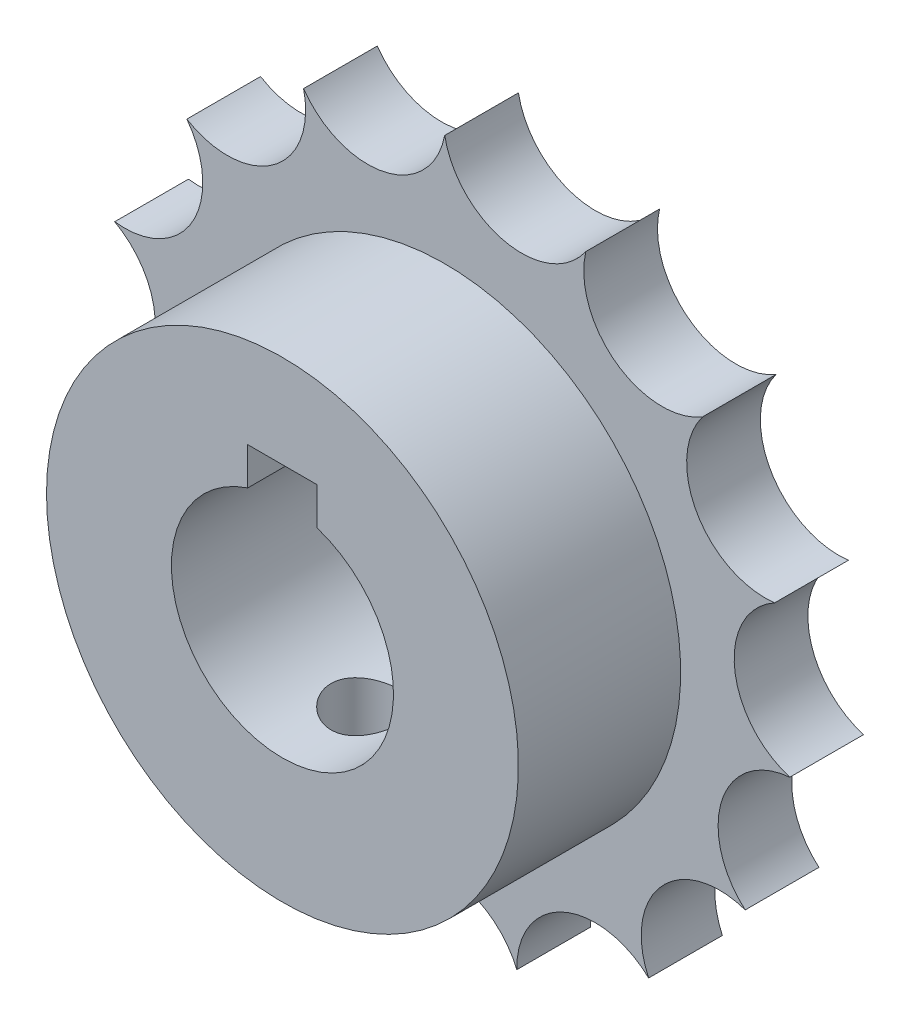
ISO-10303-21;
HEADER;
FILE_DESCRIPTION(('STEP AP214'),'2;1');
FILE_NAME('part.step','',(''),(''),'','','');
FILE_SCHEMA(('AUTOMOTIVE_DESIGN { 1 0 10303 214 1 1 1 1 }'));
ENDSEC;
DATA;
#1=APPLICATION_CONTEXT('core data for automotive mechanical design processes');
#2=APPLICATION_PROTOCOL_DEFINITION('international standard','automotive_design',2000,#1);
#3=PRODUCT_CONTEXT('',#1,'mechanical');
#4=PRODUCT('Part','Part','',(#3));
#5=PRODUCT_RELATED_PRODUCT_CATEGORY('part','',(#4));
#6=PRODUCT_DEFINITION_FORMATION('','',#4);
#7=PRODUCT_DEFINITION_CONTEXT('part definition',#1,'design');
#8=PRODUCT_DEFINITION('design','',#6,#7);
#9=PRODUCT_DEFINITION_SHAPE('','',#8);
#10=(LENGTH_UNIT() NAMED_UNIT(*) SI_UNIT(.MILLI.,.METRE.));
#11=(NAMED_UNIT(*) PLANE_ANGLE_UNIT() SI_UNIT($,.RADIAN.));
#12=(NAMED_UNIT(*) SI_UNIT($,.STERADIAN.) SOLID_ANGLE_UNIT());
#13=UNCERTAINTY_MEASURE_WITH_UNIT(LENGTH_MEASURE(1.E-05),#10,'distance_accuracy_value','');
#14=(GEOMETRIC_REPRESENTATION_CONTEXT(3) GLOBAL_UNCERTAINTY_ASSIGNED_CONTEXT((#13)) GLOBAL_UNIT_ASSIGNED_CONTEXT((#10,
#11,#12)) REPRESENTATION_CONTEXT('',''));
#15=CARTESIAN_POINT('',(0.,0.,0.));
#16=DIRECTION('',(0.,0.,1.));
#17=DIRECTION('',(1.,0.,0.));
#18=AXIS2_PLACEMENT_3D('',#15,#16,#17);
#19=CARTESIAN_POINT('',(0.,0.,17.));
#20=DIRECTION('',(0.,0.,-1.));
#21=DIRECTION('',(-1.,0.,0.));
#22=AXIS2_PLACEMENT_3D('',#19,#20,#21);
#23=CYLINDRICAL_SURFACE('',#22,17.);
#24=CARTESIAN_POINT('',(0.,0.,17.));
#25=DIRECTION('',(0.,0.,-1.));
#26=DIRECTION('',(-1.,0.,0.));
#27=AXIS2_PLACEMENT_3D('',#24,#25,#26);
#28=CIRCLE('',#27,17.);
#29=CARTESIAN_POINT('',(-17.,0.,17.));
#30=VERTEX_POINT('',#29);
#31=EDGE_CURVE('E157',#30,#30,#28,.T.);
#32=ORIENTED_EDGE('',*,*,#31,.T.);
#33=EDGE_LOOP('',(#32));
#34=FACE_BOUND('',#33,.T.);
#35=CARTESIAN_POINT('',(-2.5,-16.8151717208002,11.));
#36=CARTESIAN_POINT('',(-2.49999421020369,-16.8151740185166,11.1396090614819));
#37=CARTESIAN_POINT('',(-2.48826605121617,-16.8169291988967,11.2792999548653));
#38=CARTESIAN_POINT('',(-2.44167444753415,-16.8237557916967,11.5547784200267));
#39=CARTESIAN_POINT('',(-2.40678823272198,-16.8288304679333,11.6905620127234));
#40=CARTESIAN_POINT('',(-2.31494484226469,-16.8417091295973,11.9541983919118));
#41=CARTESIAN_POINT('',(-2.25800435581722,-16.8495110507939,12.0820570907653));
#42=CARTESIAN_POINT('',(-2.12370763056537,-16.8669626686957,12.3263864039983));
#43=CARTESIAN_POINT('',(-2.04635428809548,-16.8766121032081,12.4428586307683));
#44=CARTESIAN_POINT('',(-1.87279136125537,-16.8967545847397,12.6620243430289));
#45=CARTESIAN_POINT('',(-1.77645562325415,-16.907252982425,12.7646174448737));
#46=CARTESIAN_POINT('',(-1.56793485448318,-16.9278626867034,12.9522431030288));
#47=CARTESIAN_POINT('',(-1.45574896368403,-16.9379739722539,13.0372747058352));
#48=CARTESIAN_POINT('',(-1.2180707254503,-16.9567260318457,13.1877328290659));
#49=CARTESIAN_POINT('',(-1.09251937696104,-16.9653598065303,13.2530670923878));
#50=CARTESIAN_POINT('',(-0.83207720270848,-16.9801248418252,13.3616840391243));
#51=CARTESIAN_POINT('',(-0.697186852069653,-16.9862562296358,13.4049678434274));
#52=CARTESIAN_POINT('',(-0.42292879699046,-16.995287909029,13.4679514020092));
#53=CARTESIAN_POINT('',(-0.283600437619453,-16.998211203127,13.4878191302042));
#54=CARTESIAN_POINT('',(-0.00355891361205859,-17.0005761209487,13.5039280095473));
#55=CARTESIAN_POINT('',(0.137154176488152,-17.0000179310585,13.5001704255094));
#56=CARTESIAN_POINT('',(0.414825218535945,-16.9955011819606,13.4692681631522));
#57=CARTESIAN_POINT('',(0.551803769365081,-16.9915688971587,13.4423041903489));
#58=CARTESIAN_POINT('',(0.819270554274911,-16.9807750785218,13.3660380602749));
#59=CARTESIAN_POINT('',(0.949758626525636,-16.9739134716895,13.3167353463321));
#60=CARTESIAN_POINT('',(1.20108890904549,-16.9579867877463,13.1970053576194));
#61=CARTESIAN_POINT('',(1.32189422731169,-16.9489137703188,13.1265017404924));
#62=CARTESIAN_POINT('',(1.55002749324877,-16.9295759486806,12.9664269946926));
#63=CARTESIAN_POINT('',(1.65735458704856,-16.9193110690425,12.8768546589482));
#64=CARTESIAN_POINT('',(1.85654954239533,-16.8986202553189,12.6801777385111));
#65=CARTESIAN_POINT('',(1.94826166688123,-16.8881937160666,12.5729154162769));
#66=CARTESIAN_POINT('',(2.11240792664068,-16.8684495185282,12.3444399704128));
#67=CARTESIAN_POINT('',(2.18484195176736,-16.859131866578,12.2232267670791));
#68=CARTESIAN_POINT('',(2.30839536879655,-16.8426606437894,11.9701310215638));
#69=CARTESIAN_POINT('',(2.35949920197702,-16.8355086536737,11.8382407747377));
#70=CARTESIAN_POINT('',(2.43878726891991,-16.8242068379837,11.5676208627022));
#71=CARTESIAN_POINT('',(2.46697305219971,-16.8200568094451,11.4288916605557));
#72=CARTESIAN_POINT('',(2.49941227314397,-16.8152671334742,11.149916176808));
#73=CARTESIAN_POINT('',(2.50388627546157,-16.814595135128,11.009696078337));
#74=CARTESIAN_POINT('',(2.48935977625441,-16.8167517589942,10.7305081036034));
#75=CARTESIAN_POINT('',(2.47035997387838,-16.8195802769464,10.5915401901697));
#76=CARTESIAN_POINT('',(2.4096120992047,-16.8283895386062,10.3194818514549));
#77=CARTESIAN_POINT('',(2.36797352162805,-16.8343551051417,10.1863664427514));
#78=CARTESIAN_POINT('',(2.2632438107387,-16.8487538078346,9.92900467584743));
#79=CARTESIAN_POINT('',(2.20015165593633,-16.8571870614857,9.80475874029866));
#80=CARTESIAN_POINT('',(2.05377424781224,-16.8756473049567,9.56767291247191));
#81=CARTESIAN_POINT('',(1.97034597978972,-16.8856854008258,9.45492219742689));
#82=CARTESIAN_POINT('',(1.78586380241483,-16.9061906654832,9.24494324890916));
#83=CARTESIAN_POINT('',(1.68480893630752,-16.9166578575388,9.14771585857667));
#84=CARTESIAN_POINT('',(1.46697176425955,-16.9369428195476,8.97075356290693));
#85=CARTESIAN_POINT('',(1.35007021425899,-16.9467547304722,8.89116467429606));
#86=CARTESIAN_POINT('',(1.10442863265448,-16.9645329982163,8.75275504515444));
#87=CARTESIAN_POINT('',(0.975688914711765,-16.9724994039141,8.69393375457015));
#88=CARTESIAN_POINT('',(0.710485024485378,-16.9856633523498,8.59896334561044));
#89=CARTESIAN_POINT('',(0.574050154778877,-16.9908707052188,8.56273381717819));
#90=CARTESIAN_POINT('',(0.296951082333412,-16.9979709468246,8.51371493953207));
#91=CARTESIAN_POINT('',(0.156287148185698,-16.999864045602,8.50092410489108));
#92=CARTESIAN_POINT('',(-0.123859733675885,-17.0001205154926,8.4991808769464));
#93=CARTESIAN_POINT('',(-0.26334131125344,-16.9985169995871,8.51000485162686));
#94=CARTESIAN_POINT('',(-0.538478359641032,-16.9920270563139,8.55470536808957));
#95=CARTESIAN_POINT('',(-0.674133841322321,-16.9871406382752,8.58858184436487));
#96=CARTESIAN_POINT('',(-0.937710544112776,-16.9746313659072,8.67834751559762));
#97=CARTESIAN_POINT('',(-1.06563692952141,-16.9670103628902,8.73422182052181));
#98=CARTESIAN_POINT('',(-1.31033385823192,-16.9498698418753,8.8663733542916));
#99=CARTESIAN_POINT('',(-1.42710406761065,-16.9403502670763,8.94265119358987));
#100=CARTESIAN_POINT('',(-1.64730939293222,-16.9203641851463,9.11425567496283));
#101=CARTESIAN_POINT('',(-1.75061499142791,-16.9098899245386,9.20974762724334));
#102=CARTESIAN_POINT('',(-1.93981763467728,-16.8892329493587,9.41672202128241));
#103=CARTESIAN_POINT('',(-2.0257105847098,-16.8790503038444,9.52820821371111));
#104=CARTESIAN_POINT('',(-2.17806321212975,-16.8600707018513,9.76471097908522));
#105=CARTESIAN_POINT('',(-2.24441570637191,-16.8512815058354,9.88979720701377));
#106=CARTESIAN_POINT('',(-2.35507140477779,-16.8361748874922,10.1494074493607));
#107=CARTESIAN_POINT('',(-2.39939763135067,-16.8298548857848,10.2839214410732));
#108=CARTESIAN_POINT('',(-2.45461211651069,-16.8218718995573,10.5158765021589));
#109=CARTESIAN_POINT('',(-2.47160673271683,-16.8193725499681,10.6118807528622));
#110=CARTESIAN_POINT('',(-2.49430262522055,-16.8160216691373,10.8052434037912));
#111=CARTESIAN_POINT('',(-2.50000403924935,-16.8151701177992,10.9026017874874));
#112=CARTESIAN_POINT('',(-2.5,-16.8151717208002,11.));
#113=B_SPLINE_CURVE_WITH_KNOTS('',3,(#35,#36,#37,#38,#39,#40,#41,#42,#43,#44,#45,#46,#47,#48,
#49,#50,#51,#52,#53,#54,#55,#56,#57,#58,#59,#60,#61,#62,#63,#64,#65,#66,#67,#68,#69,#70,#71,#72,
#73,#74,#75,#76,#77,#78,#79,#80,#81,#82,#83,#84,#85,#86,#87,#88,#89,#90,#91,#92,#93,#94,#95,#96,
#97,#98,#99,#100,#101,#102,#103,#104,#105,#106,#107,#108,#109,#110,#111,#112),.UNSPECIFIED.,.T.,
.F.,(4,2,2,2,2,2,2,2,2,2,2,2,2,2,2,2,2,2,2,2,2,2,2,2,2,2,2,2,2,2,2,2,2,2,2,2,2,2,4),(0.,
0.41847120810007,0.837354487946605,1.25592140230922,1.67442895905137,2.09581782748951,
2.51722956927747,2.94058547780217,3.36391986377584,3.78419863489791,4.2044549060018,
4.62146799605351,5.03849147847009,5.45703497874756,5.87560498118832,6.29813197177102,
6.72066137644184,7.14349844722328,7.56630692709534,7.98517549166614,8.40403158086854,
8.82087962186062,9.23774751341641,9.65763620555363,10.0775476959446,10.5008152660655,
10.9240716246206,11.3458127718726,11.7675271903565,12.1852653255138,12.6030022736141,
13.0204569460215,13.4379241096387,13.8591496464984,14.2804741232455,14.7040683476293,
15.1272188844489,15.4191687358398,15.7111150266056),.UNSPECIFIED.);
#114=CARTESIAN_POINT('',(-2.5,-16.8151717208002,11.));
#115=VERTEX_POINT('',#114);
#116=EDGE_CURVE('E381',#115,#115,#113,.T.);
#117=ORIENTED_EDGE('',*,*,#116,.T.);
#118=EDGE_LOOP('',(#117));
#119=FACE_BOUND('',#118,.T.);
#120=CARTESIAN_POINT('',(0.,0.,5.31));
#121=DIRECTION('',(0.,0.,-1.));
#122=DIRECTION('',(-1.,0.,0.));
#123=AXIS2_PLACEMENT_3D('',#120,#121,#122);
#124=CIRCLE('',#123,17.);
#125=CARTESIAN_POINT('',(-17.,0.,5.31));
#126=VERTEX_POINT('',#125);
#127=EDGE_CURVE('E20',#126,#126,#124,.F.);
#128=ORIENTED_EDGE('',*,*,#127,.T.);
#129=EDGE_LOOP('',(#128));
#130=FACE_BOUND('',#129,.T.);
#131=ADVANCED_FACE('F16',(#34,#119,#130),#23,.T.);
#132=CARTESIAN_POINT('',(0.,0.,5.31));
#133=DIRECTION('',(0.,0.,-1.));
#134=DIRECTION('',(-1.,0.,0.));
#135=AXIS2_PLACEMENT_3D('',#132,#133,#134);
#136=PLANE('',#135);
#137=ORIENTED_EDGE('',*,*,#127,.F.);
#138=EDGE_LOOP('',(#137));
#139=FACE_BOUND('',#138,.T.);
#140=CARTESIAN_POINT('',(-5.5383880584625,26.0560672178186,5.31));
#141=DIRECTION('',(0.,0.,1.));
#142=DIRECTION('',(1.,0.,0.));
#143=AXIS2_PLACEMENT_3D('',#140,#141,#142);
#144=CIRCLE('',#143,5.63817525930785);
#145=CARTESIAN_POINT('',(0.,25.,5.31));
#146=VERTEX_POINT('',#145);
#147=CARTESIAN_POINT('',(-10.168416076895,22.838636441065,5.31));
#148=VERTEX_POINT('',#147);
#149=EDGE_CURVE('E186',#146,#148,#144,.F.);
#150=ORIENTED_EDGE('',*,*,#149,.T.);
#151=CARTESIAN_POINT('',(-15.6575265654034,21.5507364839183,5.31));
#152=DIRECTION('',(0.,0.,1.));
#153=DIRECTION('',(1.,0.,0.));
#154=AXIS2_PLACEMENT_3D('',#151,#152,#153);
#155=CIRCLE('',#154,5.63817525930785);
#156=CARTESIAN_POINT('',(-18.5786206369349,16.7282651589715,5.31));
#157=VERTEX_POINT('',#156);
#158=EDGE_CURVE('E339',#148,#157,#155,.F.);
#159=ORIENTED_EDGE('',*,*,#158,.T.);
#160=CARTESIAN_POINT('',(-23.0693364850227,13.3190876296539,5.31));
#161=DIRECTION('',(0.,0.,1.));
#162=DIRECTION('',(1.,0.,0.));
#163=AXIS2_PLACEMENT_3D('',#160,#161,#162);
#164=CIRCLE('',#163,5.63817525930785);
#165=CARTESIAN_POINT('',(-23.7764129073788,7.72542485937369,5.31));
#166=VERTEX_POINT('',#165);
#167=EDGE_CURVE('E345',#157,#166,#164,.F.);
#168=ORIENTED_EDGE('',*,*,#167,.T.);
#169=CARTESIAN_POINT('',(-26.4922485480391,2.78444752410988,5.31));
#170=DIRECTION('',(0.,0.,1.));
#171=DIRECTION('',(1.,0.,0.));
#172=AXIS2_PLACEMENT_3D('',#169,#170,#171);
#173=CIRCLE('',#172,5.63817525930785);
#174=CARTESIAN_POINT('',(-24.8630473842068,-2.61321158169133,5.31));
#175=VERTEX_POINT('',#174);
#176=EDGE_CURVE('E348',#166,#175,#173,.F.);
#177=ORIENTED_EDGE('',*,*,#176,.T.);
#178=CARTESIAN_POINT('',(-25.3344101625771,-8.23164885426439,5.31));
#179=DIRECTION('',(0.,0.,1.));
#180=DIRECTION('',(1.,0.,0.));
#181=AXIS2_PLACEMENT_3D('',#178,#179,#180);
#182=CIRCLE('',#181,5.63817525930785);
#183=CARTESIAN_POINT('',(-21.650635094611,-12.5,5.31));
#184=VERTEX_POINT('',#183);
#185=EDGE_CURVE('E351',#175,#184,#182,.F.);
#186=ORIENTED_EDGE('',*,*,#185,.T.);
#187=CARTESIAN_POINT('',(-19.7960221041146,-17.8244183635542,5.31));
#188=DIRECTION('',(0.,0.,1.));
#189=DIRECTION('',(1.,0.,0.));
#190=AXIS2_PLACEMENT_3D('',#187,#188,#189);
#191=CIRCLE('',#190,5.63817525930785);
#192=CARTESIAN_POINT('',(-14.6946313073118,-20.2254248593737,5.31));
#193=VERTEX_POINT('',#192);
#194=EDGE_CURVE('E354',#184,#193,#191,.F.);
#195=ORIENTED_EDGE('',*,*,#194,.T.);
#196=CARTESIAN_POINT('',(-10.8347219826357,-24.3351840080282,5.31));
#197=DIRECTION('',(0.,0.,1.));
#198=DIRECTION('',(1.,0.,0.));
#199=AXIS2_PLACEMENT_3D('',#196,#197,#198);
#200=CIRCLE('',#199,5.63817525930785);
#201=CARTESIAN_POINT('',(-5.19779227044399,-24.4536900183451,5.31));
#202=VERTEX_POINT('',#201);
#203=EDGE_CURVE('E357',#193,#202,#200,.F.);
#204=ORIENTED_EDGE('',*,*,#203,.T.);
#205=CARTESIAN_POINT('',(0.,-26.6381752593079,5.31));
#206=DIRECTION('',(0.,0.,1.));
#207=DIRECTION('',(1.,0.,0.));
#208=AXIS2_PLACEMENT_3D('',#205,#206,#207);
#209=CIRCLE('',#208,5.63817525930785);
#210=CARTESIAN_POINT('',(5.19779227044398,-24.4536900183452,5.31));
#211=VERTEX_POINT('',#210);
#212=EDGE_CURVE('E360',#202,#211,#209,.F.);
#213=ORIENTED_EDGE('',*,*,#212,.T.);
#214=CARTESIAN_POINT('',(10.8347219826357,-24.3351840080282,5.31));
#215=DIRECTION('',(0.,0.,1.));
#216=DIRECTION('',(1.,0.,0.));
#217=AXIS2_PLACEMENT_3D('',#214,#215,#216);
#218=CIRCLE('',#217,5.63817525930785);
#219=CARTESIAN_POINT('',(14.6946313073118,-20.2254248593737,5.31));
#220=VERTEX_POINT('',#219);
#221=EDGE_CURVE('E363',#211,#220,#218,.F.);
#222=ORIENTED_EDGE('',*,*,#221,.T.);
#223=CARTESIAN_POINT('',(19.7960221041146,-17.8244183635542,5.31));
#224=DIRECTION('',(0.,0.,1.));
#225=DIRECTION('',(1.,0.,0.));
#226=AXIS2_PLACEMENT_3D('',#223,#224,#225);
#227=CIRCLE('',#226,5.63817525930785);
#228=CARTESIAN_POINT('',(21.650635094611,-12.5,5.31));
#229=VERTEX_POINT('',#228);
#230=EDGE_CURVE('E366',#220,#229,#227,.F.);
#231=ORIENTED_EDGE('',*,*,#230,.T.);
#232=CARTESIAN_POINT('',(25.3344101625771,-8.23164885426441,5.31));
#233=DIRECTION('',(0.,0.,1.));
#234=DIRECTION('',(1.,0.,0.));
#235=AXIS2_PLACEMENT_3D('',#232,#233,#234);
#236=CIRCLE('',#235,5.63817525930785);
#237=CARTESIAN_POINT('',(24.8630473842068,-2.61321158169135,5.31));
#238=VERTEX_POINT('',#237);
#239=EDGE_CURVE('E369',#229,#238,#236,.F.);
#240=ORIENTED_EDGE('',*,*,#239,.T.);
#241=CARTESIAN_POINT('',(26.4922485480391,2.78444752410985,5.31));
#242=DIRECTION('',(0.,0.,1.));
#243=DIRECTION('',(1.,0.,0.));
#244=AXIS2_PLACEMENT_3D('',#241,#242,#243);
#245=CIRCLE('',#244,5.63817525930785);
#246=CARTESIAN_POINT('',(23.7764129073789,7.72542485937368,5.31));
#247=VERTEX_POINT('',#246);
#248=EDGE_CURVE('E371',#238,#247,#245,.F.);
#249=ORIENTED_EDGE('',*,*,#248,.T.);
#250=CARTESIAN_POINT('',(23.0693364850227,13.3190876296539,5.31));
#251=DIRECTION('',(0.,0.,1.));
#252=DIRECTION('',(1.,0.,0.));
#253=AXIS2_PLACEMENT_3D('',#250,#251,#252);
#254=CIRCLE('',#253,5.63817525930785);
#255=CARTESIAN_POINT('',(18.5786206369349,16.7282651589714,5.31));
#256=VERTEX_POINT('',#255);
#257=EDGE_CURVE('E163',#247,#256,#254,.F.);
#258=ORIENTED_EDGE('',*,*,#257,.T.);
#259=CARTESIAN_POINT('',(15.6575265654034,21.5507364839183,5.31));
#260=DIRECTION('',(0.,0.,1.));
#261=DIRECTION('',(1.,0.,0.));
#262=AXIS2_PLACEMENT_3D('',#259,#260,#261);
#263=CIRCLE('',#262,5.63817525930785);
#264=CARTESIAN_POINT('',(10.168416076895,22.838636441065,5.31));
#265=VERTEX_POINT('',#264);
#266=EDGE_CURVE('E160',#256,#265,#263,.F.);
#267=ORIENTED_EDGE('',*,*,#266,.T.);
#268=CARTESIAN_POINT('',(5.53838805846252,26.0560672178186,5.31));
#269=DIRECTION('',(0.,0.,1.));
#270=DIRECTION('',(1.,0.,0.));
#271=AXIS2_PLACEMENT_3D('',#268,#269,#270);
#272=CIRCLE('',#271,5.63817525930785);
#273=EDGE_CURVE('E146',#265,#146,#272,.F.);
#274=ORIENTED_EDGE('',*,*,#273,.T.);
#275=EDGE_LOOP('',(#150,#159,#168,#177,#186,#195,#204,#213,#222,#231,#240,#249,#258,#267,#274));
#276=FACE_BOUND('',#275,.T.);
#277=ADVANCED_FACE('F161',(#139,#276),#136,.F.);
#278=CARTESIAN_POINT('',(0.,10.3,11.));
#279=DIRECTION('',(0.,-1.,0.));
#280=DIRECTION('',(0.,0.,-1.));
#281=AXIS2_PLACEMENT_3D('',#278,#279,#280);
#282=CYLINDRICAL_SURFACE('',#281,2.5);
#283=CARTESIAN_POINT('',(2.5,-7.59934207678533,11.));
#284=CARTESIAN_POINT('',(2.49999907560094,-7.59934291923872,10.8633059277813));
#285=CARTESIAN_POINT('',(2.48875077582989,-7.60307063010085,10.7266024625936));
#286=CARTESIAN_POINT('',(2.44418350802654,-7.61751277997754,10.4572116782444));
#287=CARTESIAN_POINT('',(2.4108585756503,-7.62822910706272,10.3245254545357));
#288=CARTESIAN_POINT('',(2.32339576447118,-7.6553187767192,10.067110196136));
#289=CARTESIAN_POINT('',(2.26929471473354,-7.67168210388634,9.94236753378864));
#290=CARTESIAN_POINT('',(2.14193828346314,-7.70820812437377,9.70369460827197));
#291=CARTESIAN_POINT('',(2.06867951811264,-7.72837148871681,9.58976626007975));
#292=CARTESIAN_POINT('',(1.90239214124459,-7.7710025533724,9.37204226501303));
#293=CARTESIAN_POINT('',(1.8088187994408,-7.79352246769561,9.26867278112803));
#294=CARTESIAN_POINT('',(1.60572409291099,-7.83788491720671,9.07880797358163));
#295=CARTESIAN_POINT('',(1.49620050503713,-7.85972735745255,8.99231500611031));
#296=CARTESIAN_POINT('',(1.26125182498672,-7.90087106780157,8.83677787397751));
#297=CARTESIAN_POINT('',(1.13552311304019,-7.9201036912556,8.76817259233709));
#298=CARTESIAN_POINT('',(0.873608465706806,-7.95325103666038,8.6532479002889));
#299=CARTESIAN_POINT('',(0.737424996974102,-7.9671670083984,8.60692325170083));
#300=CARTESIAN_POINT('',(0.462928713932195,-7.98774351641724,8.53929774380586));
#301=CARTESIAN_POINT('',(0.324811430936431,-7.99461477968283,8.5172685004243));
#302=CARTESIAN_POINT('',(0.0466816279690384,-8.00107191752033,8.49655130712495));
#303=CARTESIAN_POINT('',(-0.0933304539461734,-8.00065944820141,8.49785805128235));
#304=CARTESIAN_POINT('',(-0.366148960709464,-7.99274232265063,8.52329658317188));
#305=CARTESIAN_POINT('',(-0.499037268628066,-7.98548301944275,8.546638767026));
#306=CARTESIAN_POINT('',(-0.758906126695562,-7.9649896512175,8.61418998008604));
#307=CARTESIAN_POINT('',(-0.885886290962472,-7.95175519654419,8.65840037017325));
#308=CARTESIAN_POINT('',(-1.13215620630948,-7.92046919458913,8.76694037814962));
#309=CARTESIAN_POINT('',(-1.25133281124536,-7.90236067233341,8.83150961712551));
#310=CARTESIAN_POINT('',(-1.47740502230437,-7.86323445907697,8.97874219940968));
#311=CARTESIAN_POINT('',(-1.58429751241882,-7.84221603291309,9.06141011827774));
#312=CARTESIAN_POINT('',(-1.78747539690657,-7.79847341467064,9.24654726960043));
#313=CARTESIAN_POINT('',(-1.88313309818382,-7.77571463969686,9.34969813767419));
#314=CARTESIAN_POINT('',(-2.05597948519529,-7.73181230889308,9.57079020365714));
#315=CARTESIAN_POINT('',(-2.13316599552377,-7.71066894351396,9.68873314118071));
#316=CARTESIAN_POINT('',(-2.26760930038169,-7.6722169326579,9.93783493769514));
#317=CARTESIAN_POINT('',(-2.32463361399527,-7.65495380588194,10.0691268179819));
#318=CARTESIAN_POINT('',(-2.41556691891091,-7.62675090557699,10.340118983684));
#319=CARTESIAN_POINT('',(-2.44948421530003,-7.61580886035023,10.4798162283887));
#320=CARTESIAN_POINT('',(-2.4920297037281,-7.60199126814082,10.7576399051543));
#321=CARTESIAN_POINT('',(-2.50161908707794,-7.59880932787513,10.8956039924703));
#322=CARTESIAN_POINT('',(-2.49793488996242,-7.6000215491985,11.1711794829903));
#323=CARTESIAN_POINT('',(-2.48466484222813,-7.60441454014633,11.3087909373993));
#324=CARTESIAN_POINT('',(-2.43649747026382,-7.61997914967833,11.5756165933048));
#325=CARTESIAN_POINT('',(-2.40223662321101,-7.63095108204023,11.7049585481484));
#326=CARTESIAN_POINT('',(-2.31380747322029,-7.65822574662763,11.9560435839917));
#327=CARTESIAN_POINT('',(-2.25963592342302,-7.67452934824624,12.0777854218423));
#328=CARTESIAN_POINT('',(-2.13115021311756,-7.71121079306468,12.3140782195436));
#329=CARTESIAN_POINT('',(-2.05630294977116,-7.73169206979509,12.4283228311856));
#330=CARTESIAN_POINT('',(-1.8892128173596,-7.77420697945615,12.6429806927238));
#331=CARTESIAN_POINT('',(-1.79696542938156,-7.79624101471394,12.7433903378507));
#332=CARTESIAN_POINT('',(-1.59314589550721,-7.84048375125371,12.9318207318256));
#333=CARTESIAN_POINT('',(-1.48093129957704,-7.86266184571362,13.0191555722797));
#334=CARTESIAN_POINT('',(-1.24290309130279,-7.90378119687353,13.1737820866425));
#335=CARTESIAN_POINT('',(-1.11709010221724,-7.92272260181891,13.2410746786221));
#336=CARTESIAN_POINT('',(-0.856211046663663,-7.95512623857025,13.3530611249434));
#337=CARTESIAN_POINT('',(-0.721220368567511,-7.968627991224,13.3979185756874));
#338=CARTESIAN_POINT('',(-0.445114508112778,-7.98880485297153,13.4641450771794));
#339=CARTESIAN_POINT('',(-0.304001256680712,-7.99548209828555,13.485521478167));
#340=CARTESIAN_POINT('',(-0.0259698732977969,-8.00111606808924,13.5035820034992));
#341=CARTESIAN_POINT('',(0.110878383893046,-8.0003825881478,13.5012569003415));
#342=CARTESIAN_POINT('',(0.382146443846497,-7.99201956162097,13.4743763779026));
#343=CARTESIAN_POINT('',(0.516566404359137,-7.98439046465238,13.4498224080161));
#344=CARTESIAN_POINT('',(0.777510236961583,-7.96319141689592,13.3798119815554));
#345=CARTESIAN_POINT('',(0.904111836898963,-7.9496969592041,13.3346207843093));
#346=CARTESIAN_POINT('',(1.14799685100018,-7.918158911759,13.224858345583));
#347=CARTESIAN_POINT('',(1.26527866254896,-7.90011454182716,13.1602837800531));
#348=CARTESIAN_POINT('',(1.49152338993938,-7.86059793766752,13.0110544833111));
#349=CARTESIAN_POINT('',(1.60006921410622,-7.83903019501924,12.9257929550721));
#350=CARTESIAN_POINT('',(1.80164158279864,-7.79517473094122,12.7386802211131));
#351=CARTESIAN_POINT('',(1.89466346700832,-7.77288679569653,12.6368240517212));
#352=CARTESIAN_POINT('',(2.06565731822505,-7.72923785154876,12.4153685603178));
#353=CARTESIAN_POINT('',(2.14302855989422,-7.70793201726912,12.2952931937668));
#354=CARTESIAN_POINT('',(2.27640941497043,-7.66960250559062,12.0432037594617));
#355=CARTESIAN_POINT('',(2.33242766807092,-7.65257709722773,11.9111945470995));
#356=CARTESIAN_POINT('',(2.41742360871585,-7.62613120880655,11.6505547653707));
#357=CARTESIAN_POINT('',(2.44829879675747,-7.61618630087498,11.5225949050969));
#358=CARTESIAN_POINT('',(2.48958491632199,-7.60279212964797,11.263092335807));
#359=CARTESIAN_POINT('',(2.50000088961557,-7.59934126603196,11.131550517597));
#360=CARTESIAN_POINT('',(2.5,-7.59934207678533,11.));
#361=B_SPLINE_CURVE_WITH_KNOTS('',3,(#283,#284,#285,#286,#287,#288,#289,#290,#291,#292,#293,
#294,#295,#296,#297,#298,#299,#300,#301,#302,#303,#304,#305,#306,#307,#308,#309,#310,#311,#312,
#313,#314,#315,#316,#317,#318,#319,#320,#321,#322,#323,#324,#325,#326,#327,#328,#329,#330,#331,
#332,#333,#334,#335,#336,#337,#338,#339,#340,#341,#342,#343,#344,#345,#346,#347,#348,#349,#350,
#351,#352,#353,#354,#355,#356,#357,#358,#359,#360),.UNSPECIFIED.,.T.,.F.,(4,2,2,2,2,2,2,2,2,2,2,
2,2,2,2,2,2,2,2,2,2,2,2,2,2,2,2,2,2,2,2,2,2,2,2,2,2,2,4),(0.,0.409596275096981,
0.819303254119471,1.22828728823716,1.6373436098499,2.05914161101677,2.48099845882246,
2.91239643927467,3.34369294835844,3.76167445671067,4.17956092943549,4.58301965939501,
4.98650470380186,5.39492809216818,5.80345485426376,6.22900677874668,6.65460879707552,
7.08496941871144,7.5151752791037,7.92809866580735,8.34095824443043,8.7418794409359,
9.14286604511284,9.55535226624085,9.96794576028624,10.3976387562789,10.8273120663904,
11.2538047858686,11.6801639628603,12.0887760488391,12.4973614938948,12.9008369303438,
13.3043815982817,13.7216138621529,14.1389711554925,14.5701559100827,15.0011660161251,
15.3954470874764,15.7896309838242),.UNSPECIFIED.);
#362=CARTESIAN_POINT('',(2.5,-7.59934207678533,11.));
#363=VERTEX_POINT('',#362);
#364=EDGE_CURVE('E179',#363,#363,#361,.T.);
#365=ORIENTED_EDGE('',*,*,#364,.T.);
#366=EDGE_LOOP('',(#365));
#367=FACE_BOUND('',#366,.T.);
#368=ORIENTED_EDGE('',*,*,#116,.F.);
#369=EDGE_LOOP('',(#368));
#370=FACE_BOUND('',#369,.T.);
#371=ADVANCED_FACE('F241',(#367,#370),#282,.F.);
#372=CARTESIAN_POINT('',(0.,0.,17.));
#373=DIRECTION('',(0.,0.,-1.));
#374=DIRECTION('',(-1.,0.,0.));
#375=AXIS2_PLACEMENT_3D('',#372,#373,#374);
#376=PLANE('',#375);
#377=DIRECTION('',(1.,0.,0.));
#378=VECTOR('',#377,1.);
#379=CARTESIAN_POINT('',(-2.5,10.3,17.));
#380=LINE('',#379,#378);
#381=CARTESIAN_POINT('',(-2.5,10.3,17.));
#382=VERTEX_POINT('',#381);
#383=CARTESIAN_POINT('',(2.5,10.3,17.));
#384=VERTEX_POINT('',#383);
#385=EDGE_CURVE('E180',#382,#384,#380,.T.);
#386=ORIENTED_EDGE('',*,*,#385,.T.);
#387=DIRECTION('',(0.,1.,0.));
#388=VECTOR('',#387,1.);
#389=CARTESIAN_POINT('',(2.5,10.3,17.));
#390=LINE('',#389,#388);
#391=CARTESIAN_POINT('',(2.5,7.59934207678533,17.));
#392=VERTEX_POINT('',#391);
#393=EDGE_CURVE('E176',#384,#392,#390,.F.);
#394=ORIENTED_EDGE('',*,*,#393,.T.);
#395=CARTESIAN_POINT('',(0.,0.,17.));
#396=DIRECTION('',(0.,0.,1.));
#397=DIRECTION('',(1.,0.,0.));
#398=AXIS2_PLACEMENT_3D('',#395,#396,#397);
#399=CIRCLE('',#398,8.);
#400=CARTESIAN_POINT('',(-2.5,7.59934207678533,17.));
#401=VERTEX_POINT('',#400);
#402=EDGE_CURVE('E239',#392,#401,#399,.F.);
#403=ORIENTED_EDGE('',*,*,#402,.T.);
#404=DIRECTION('',(0.,1.,0.));
#405=VECTOR('',#404,1.);
#406=CARTESIAN_POINT('',(-2.5,7.59934207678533,17.));
#407=LINE('',#406,#405);
#408=EDGE_CURVE('E183',#401,#382,#407,.T.);
#409=ORIENTED_EDGE('',*,*,#408,.T.);
#410=EDGE_LOOP('',(#386,#394,#403,#409));
#411=FACE_BOUND('',#410,.T.);
#412=ORIENTED_EDGE('',*,*,#31,.F.);
#413=EDGE_LOOP('',(#412));
#414=FACE_BOUND('',#413,.T.);
#415=ADVANCED_FACE('F311',(#411,#414),#376,.F.);
#416=CARTESIAN_POINT('',(5.53838805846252,26.0560672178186,0.));
#417=DIRECTION('',(0.,0.,1.));
#418=DIRECTION('',(1.,0.,0.));
#419=AXIS2_PLACEMENT_3D('',#416,#417,#418);
#420=CYLINDRICAL_SURFACE('',#419,5.63817525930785);
#421=DIRECTION('',(0.,0.,1.));
#422=VECTOR('',#421,1.);
#423=CARTESIAN_POINT('',(10.168416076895,22.838636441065,0.));
#424=LINE('',#423,#422);
#425=CARTESIAN_POINT('',(10.168416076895,22.838636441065,0.));
#426=VERTEX_POINT('',#425);
#427=EDGE_CURVE('E150',#265,#426,#424,.F.);
#428=ORIENTED_EDGE('',*,*,#427,.T.);
#429=CARTESIAN_POINT('',(5.53838805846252,26.0560672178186,0.));
#430=DIRECTION('',(0.,0.,1.));
#431=DIRECTION('',(1.,0.,0.));
#432=AXIS2_PLACEMENT_3D('',#429,#430,#431);
#433=CIRCLE('',#432,5.63817525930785);
#434=CARTESIAN_POINT('',(0.,25.,0.));
#435=VERTEX_POINT('',#434);
#436=EDGE_CURVE('E231',#435,#426,#433,.T.);
#437=ORIENTED_EDGE('',*,*,#436,.F.);
#438=DIRECTION('',(0.,0.,1.));
#439=VECTOR('',#438,1.);
#440=CARTESIAN_POINT('',(0.,25.,0.));
#441=LINE('',#440,#439);
#442=EDGE_CURVE('E153',#435,#146,#441,.T.);
#443=ORIENTED_EDGE('',*,*,#442,.T.);
#444=ORIENTED_EDGE('',*,*,#273,.F.);
#445=EDGE_LOOP('',(#428,#437,#443,#444));
#446=FACE_BOUND('',#445,.T.);
#447=ADVANCED_FACE('F148',(#446),#420,.F.);
#448=CARTESIAN_POINT('',(15.6575265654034,21.5507364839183,0.));
#449=DIRECTION('',(0.,0.,1.));
#450=DIRECTION('',(1.,0.,0.));
#451=AXIS2_PLACEMENT_3D('',#448,#449,#450);
#452=CYLINDRICAL_SURFACE('',#451,5.63817525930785);
#453=DIRECTION('',(0.,0.,1.));
#454=VECTOR('',#453,1.);
#455=CARTESIAN_POINT('',(18.5786206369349,16.7282651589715,0.));
#456=LINE('',#455,#454);
#457=CARTESIAN_POINT('',(18.5786206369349,16.7282651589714,0.));
#458=VERTEX_POINT('',#457);
#459=EDGE_CURVE('E166',#256,#458,#456,.F.);
#460=ORIENTED_EDGE('',*,*,#459,.T.);
#461=CARTESIAN_POINT('',(15.6575265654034,21.5507364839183,0.));
#462=DIRECTION('',(0.,0.,1.));
#463=DIRECTION('',(1.,0.,0.));
#464=AXIS2_PLACEMENT_3D('',#461,#462,#463);
#465=CIRCLE('',#464,5.63817525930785);
#466=EDGE_CURVE('E170',#426,#458,#465,.T.);
#467=ORIENTED_EDGE('',*,*,#466,.F.);
#468=ORIENTED_EDGE('',*,*,#427,.F.);
#469=ORIENTED_EDGE('',*,*,#266,.F.);
#470=EDGE_LOOP('',(#460,#467,#468,#469));
#471=FACE_BOUND('',#470,.T.);
#472=ADVANCED_FACE('F168',(#471),#452,.F.);
#473=CARTESIAN_POINT('',(23.0693364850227,13.3190876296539,0.));
#474=DIRECTION('',(0.,0.,1.));
#475=DIRECTION('',(1.,0.,0.));
#476=AXIS2_PLACEMENT_3D('',#473,#474,#475);
#477=CYLINDRICAL_SURFACE('',#476,5.63817525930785);
#478=DIRECTION('',(0.,0.,1.));
#479=VECTOR('',#478,1.);
#480=CARTESIAN_POINT('',(23.7764129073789,7.72542485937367,0.));
#481=LINE('',#480,#479);
#482=CARTESIAN_POINT('',(23.7764129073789,7.72542485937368,0.));
#483=VERTEX_POINT('',#482);
#484=EDGE_CURVE('E372',#247,#483,#481,.F.);
#485=ORIENTED_EDGE('',*,*,#484,.T.);
#486=CARTESIAN_POINT('',(23.0693364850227,13.3190876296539,0.));
#487=DIRECTION('',(0.,0.,1.));
#488=DIRECTION('',(1.,0.,0.));
#489=AXIS2_PLACEMENT_3D('',#486,#487,#488);
#490=CIRCLE('',#489,5.63817525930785);
#491=EDGE_CURVE('E227',#458,#483,#490,.T.);
#492=ORIENTED_EDGE('',*,*,#491,.F.);
#493=ORIENTED_EDGE('',*,*,#459,.F.);
#494=ORIENTED_EDGE('',*,*,#257,.F.);
#495=EDGE_LOOP('',(#485,#492,#493,#494));
#496=FACE_BOUND('',#495,.T.);
#497=ADVANCED_FACE('F303',(#496),#477,.F.);
#498=CARTESIAN_POINT('',(26.4922485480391,2.78444752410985,0.));
#499=DIRECTION('',(0.,0.,1.));
#500=DIRECTION('',(1.,0.,0.));
#501=AXIS2_PLACEMENT_3D('',#498,#499,#500);
#502=CYLINDRICAL_SURFACE('',#501,5.63817525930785);
#503=DIRECTION('',(0.,0.,1.));
#504=VECTOR('',#503,1.);
#505=CARTESIAN_POINT('',(24.8630473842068,-2.61321158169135,0.));
#506=LINE('',#505,#504);
#507=CARTESIAN_POINT('',(24.8630473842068,-2.61321158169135,0.));
#508=VERTEX_POINT('',#507);
#509=EDGE_CURVE('E370',#238,#508,#506,.F.);
#510=ORIENTED_EDGE('',*,*,#509,.T.);
#511=CARTESIAN_POINT('',(26.4922485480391,2.78444752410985,0.));
#512=DIRECTION('',(0.,0.,1.));
#513=DIRECTION('',(1.,0.,0.));
#514=AXIS2_PLACEMENT_3D('',#511,#512,#513);
#515=CIRCLE('',#514,5.63817525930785);
#516=EDGE_CURVE('E224',#483,#508,#515,.T.);
#517=ORIENTED_EDGE('',*,*,#516,.F.);
#518=ORIENTED_EDGE('',*,*,#484,.F.);
#519=ORIENTED_EDGE('',*,*,#248,.F.);
#520=EDGE_LOOP('',(#510,#517,#518,#519));
#521=FACE_BOUND('',#520,.T.);
#522=ADVANCED_FACE('F299',(#521),#502,.F.);
#523=CARTESIAN_POINT('',(25.3344101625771,-8.23164885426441,0.));
#524=DIRECTION('',(0.,0.,1.));
#525=DIRECTION('',(1.,0.,0.));
#526=AXIS2_PLACEMENT_3D('',#523,#524,#525);
#527=CYLINDRICAL_SURFACE('',#526,5.63817525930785);
#528=DIRECTION('',(0.,0.,1.));
#529=VECTOR('',#528,1.);
#530=CARTESIAN_POINT('',(21.650635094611,-12.5,0.));
#531=LINE('',#530,#529);
#532=CARTESIAN_POINT('',(21.650635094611,-12.5,0.));
#533=VERTEX_POINT('',#532);
#534=EDGE_CURVE('E367',#229,#533,#531,.F.);
#535=ORIENTED_EDGE('',*,*,#534,.T.);
#536=CARTESIAN_POINT('',(25.3344101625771,-8.23164885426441,0.));
#537=DIRECTION('',(0.,0.,1.));
#538=DIRECTION('',(1.,0.,0.));
#539=AXIS2_PLACEMENT_3D('',#536,#537,#538);
#540=CIRCLE('',#539,5.63817525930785);
#541=EDGE_CURVE('E221',#508,#533,#540,.T.);
#542=ORIENTED_EDGE('',*,*,#541,.F.);
#543=ORIENTED_EDGE('',*,*,#509,.F.);
#544=ORIENTED_EDGE('',*,*,#239,.F.);
#545=EDGE_LOOP('',(#535,#542,#543,#544));
#546=FACE_BOUND('',#545,.T.);
#547=ADVANCED_FACE('F295',(#546),#527,.F.);
#548=CARTESIAN_POINT('',(19.7960221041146,-17.8244183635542,0.));
#549=DIRECTION('',(0.,0.,1.));
#550=DIRECTION('',(1.,0.,0.));
#551=AXIS2_PLACEMENT_3D('',#548,#549,#550);
#552=CYLINDRICAL_SURFACE('',#551,5.63817525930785);
#553=DIRECTION('',(0.,0.,1.));
#554=VECTOR('',#553,1.);
#555=CARTESIAN_POINT('',(14.6946313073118,-20.2254248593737,0.));
#556=LINE('',#555,#554);
#557=CARTESIAN_POINT('',(14.6946313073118,-20.2254248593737,0.));
#558=VERTEX_POINT('',#557);
#559=EDGE_CURVE('E364',#220,#558,#556,.F.);
#560=ORIENTED_EDGE('',*,*,#559,.T.);
#561=CARTESIAN_POINT('',(19.7960221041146,-17.8244183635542,0.));
#562=DIRECTION('',(0.,0.,1.));
#563=DIRECTION('',(1.,0.,0.));
#564=AXIS2_PLACEMENT_3D('',#561,#562,#563);
#565=CIRCLE('',#564,5.63817525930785);
#566=EDGE_CURVE('E218',#533,#558,#565,.T.);
#567=ORIENTED_EDGE('',*,*,#566,.F.);
#568=ORIENTED_EDGE('',*,*,#534,.F.);
#569=ORIENTED_EDGE('',*,*,#230,.F.);
#570=EDGE_LOOP('',(#560,#567,#568,#569));
#571=FACE_BOUND('',#570,.T.);
#572=ADVANCED_FACE('F291',(#571),#552,.F.);
#573=CARTESIAN_POINT('',(10.8347219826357,-24.3351840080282,0.));
#574=DIRECTION('',(0.,0.,1.));
#575=DIRECTION('',(1.,0.,0.));
#576=AXIS2_PLACEMENT_3D('',#573,#574,#575);
#577=CYLINDRICAL_SURFACE('',#576,5.63817525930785);
#578=DIRECTION('',(0.,0.,1.));
#579=VECTOR('',#578,1.);
#580=CARTESIAN_POINT('',(5.19779227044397,-24.4536900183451,0.));
#581=LINE('',#580,#579);
#582=CARTESIAN_POINT('',(5.19779227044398,-24.4536900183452,0.));
#583=VERTEX_POINT('',#582);
#584=EDGE_CURVE('E361',#211,#583,#581,.F.);
#585=ORIENTED_EDGE('',*,*,#584,.T.);
#586=CARTESIAN_POINT('',(10.8347219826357,-24.3351840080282,0.));
#587=DIRECTION('',(0.,0.,1.));
#588=DIRECTION('',(1.,0.,0.));
#589=AXIS2_PLACEMENT_3D('',#586,#587,#588);
#590=CIRCLE('',#589,5.63817525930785);
#591=EDGE_CURVE('E215',#558,#583,#590,.T.);
#592=ORIENTED_EDGE('',*,*,#591,.F.);
#593=ORIENTED_EDGE('',*,*,#559,.F.);
#594=ORIENTED_EDGE('',*,*,#221,.F.);
#595=EDGE_LOOP('',(#585,#592,#593,#594));
#596=FACE_BOUND('',#595,.T.);
#597=ADVANCED_FACE('F287',(#596),#577,.F.);
#598=CARTESIAN_POINT('',(0.,-26.6381752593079,0.));
#599=DIRECTION('',(0.,0.,1.));
#600=DIRECTION('',(1.,0.,0.));
#601=AXIS2_PLACEMENT_3D('',#598,#599,#600);
#602=CYLINDRICAL_SURFACE('',#601,5.63817525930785);
#603=DIRECTION('',(0.,0.,1.));
#604=VECTOR('',#603,1.);
#605=CARTESIAN_POINT('',(-5.19779227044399,-24.4536900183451,0.));
#606=LINE('',#605,#604);
#607=CARTESIAN_POINT('',(-5.19779227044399,-24.4536900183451,0.));
#608=VERTEX_POINT('',#607);
#609=EDGE_CURVE('E358',#202,#608,#606,.F.);
#610=ORIENTED_EDGE('',*,*,#609,.T.);
#611=CARTESIAN_POINT('',(0.,-26.6381752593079,0.));
#612=DIRECTION('',(0.,0.,1.));
#613=DIRECTION('',(1.,0.,0.));
#614=AXIS2_PLACEMENT_3D('',#611,#612,#613);
#615=CIRCLE('',#614,5.63817525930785);
#616=EDGE_CURVE('E212',#583,#608,#615,.T.);
#617=ORIENTED_EDGE('',*,*,#616,.F.);
#618=ORIENTED_EDGE('',*,*,#584,.F.);
#619=ORIENTED_EDGE('',*,*,#212,.F.);
#620=EDGE_LOOP('',(#610,#617,#618,#619));
#621=FACE_BOUND('',#620,.T.);
#622=ADVANCED_FACE('F283',(#621),#602,.F.);
#623=CARTESIAN_POINT('',(-10.8347219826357,-24.3351840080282,0.));
#624=DIRECTION('',(0.,0.,1.));
#625=DIRECTION('',(1.,0.,0.));
#626=AXIS2_PLACEMENT_3D('',#623,#624,#625);
#627=CYLINDRICAL_SURFACE('',#626,5.63817525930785);
#628=DIRECTION('',(0.,0.,1.));
#629=VECTOR('',#628,1.);
#630=CARTESIAN_POINT('',(-14.6946313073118,-20.2254248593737,0.));
#631=LINE('',#630,#629);
#632=CARTESIAN_POINT('',(-14.6946313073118,-20.2254248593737,0.));
#633=VERTEX_POINT('',#632);
#634=EDGE_CURVE('E355',#193,#633,#631,.F.);
#635=ORIENTED_EDGE('',*,*,#634,.T.);
#636=CARTESIAN_POINT('',(-10.8347219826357,-24.3351840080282,0.));
#637=DIRECTION('',(0.,0.,1.));
#638=DIRECTION('',(1.,0.,0.));
#639=AXIS2_PLACEMENT_3D('',#636,#637,#638);
#640=CIRCLE('',#639,5.63817525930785);
#641=EDGE_CURVE('E209',#608,#633,#640,.T.);
#642=ORIENTED_EDGE('',*,*,#641,.F.);
#643=ORIENTED_EDGE('',*,*,#609,.F.);
#644=ORIENTED_EDGE('',*,*,#203,.F.);
#645=EDGE_LOOP('',(#635,#642,#643,#644));
#646=FACE_BOUND('',#645,.T.);
#647=ADVANCED_FACE('F279',(#646),#627,.F.);
#648=CARTESIAN_POINT('',(-19.7960221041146,-17.8244183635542,0.));
#649=DIRECTION('',(0.,0.,1.));
#650=DIRECTION('',(1.,0.,0.));
#651=AXIS2_PLACEMENT_3D('',#648,#649,#650);
#652=CYLINDRICAL_SURFACE('',#651,5.63817525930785);
#653=DIRECTION('',(0.,0.,1.));
#654=VECTOR('',#653,1.);
#655=CARTESIAN_POINT('',(-21.650635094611,-12.5,0.));
#656=LINE('',#655,#654);
#657=CARTESIAN_POINT('',(-21.650635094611,-12.5,0.));
#658=VERTEX_POINT('',#657);
#659=EDGE_CURVE('E352',#184,#658,#656,.F.);
#660=ORIENTED_EDGE('',*,*,#659,.T.);
#661=CARTESIAN_POINT('',(-19.7960221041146,-17.8244183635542,0.));
#662=DIRECTION('',(0.,0.,1.));
#663=DIRECTION('',(1.,0.,0.));
#664=AXIS2_PLACEMENT_3D('',#661,#662,#663);
#665=CIRCLE('',#664,5.63817525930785);
#666=EDGE_CURVE('E206',#633,#658,#665,.T.);
#667=ORIENTED_EDGE('',*,*,#666,.F.);
#668=ORIENTED_EDGE('',*,*,#634,.F.);
#669=ORIENTED_EDGE('',*,*,#194,.F.);
#670=EDGE_LOOP('',(#660,#667,#668,#669));
#671=FACE_BOUND('',#670,.T.);
#672=ADVANCED_FACE('F275',(#671),#652,.F.);
#673=CARTESIAN_POINT('',(-25.3344101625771,-8.23164885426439,0.));
#674=DIRECTION('',(0.,0.,1.));
#675=DIRECTION('',(1.,0.,0.));
#676=AXIS2_PLACEMENT_3D('',#673,#674,#675);
#677=CYLINDRICAL_SURFACE('',#676,5.63817525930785);
#678=DIRECTION('',(0.,0.,1.));
#679=VECTOR('',#678,1.);
#680=CARTESIAN_POINT('',(-24.8630473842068,-2.61321158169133,0.));
#681=LINE('',#680,#679);
#682=CARTESIAN_POINT('',(-24.8630473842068,-2.61321158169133,0.));
#683=VERTEX_POINT('',#682);
#684=EDGE_CURVE('E349',#175,#683,#681,.F.);
#685=ORIENTED_EDGE('',*,*,#684,.T.);
#686=CARTESIAN_POINT('',(-25.3344101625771,-8.23164885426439,0.));
#687=DIRECTION('',(0.,0.,1.));
#688=DIRECTION('',(1.,0.,0.));
#689=AXIS2_PLACEMENT_3D('',#686,#687,#688);
#690=CIRCLE('',#689,5.63817525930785);
#691=EDGE_CURVE('E203',#658,#683,#690,.T.);
#692=ORIENTED_EDGE('',*,*,#691,.F.);
#693=ORIENTED_EDGE('',*,*,#659,.F.);
#694=ORIENTED_EDGE('',*,*,#185,.F.);
#695=EDGE_LOOP('',(#685,#692,#693,#694));
#696=FACE_BOUND('',#695,.T.);
#697=ADVANCED_FACE('F271',(#696),#677,.F.);
#698=CARTESIAN_POINT('',(-26.4922485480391,2.78444752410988,0.));
#699=DIRECTION('',(0.,0.,1.));
#700=DIRECTION('',(1.,0.,0.));
#701=AXIS2_PLACEMENT_3D('',#698,#699,#700);
#702=CYLINDRICAL_SURFACE('',#701,5.63817525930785);
#703=DIRECTION('',(0.,0.,1.));
#704=VECTOR('',#703,1.);
#705=CARTESIAN_POINT('',(-23.7764129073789,7.72542485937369,0.));
#706=LINE('',#705,#704);
#707=CARTESIAN_POINT('',(-23.7764129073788,7.72542485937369,0.));
#708=VERTEX_POINT('',#707);
#709=EDGE_CURVE('E346',#166,#708,#706,.F.);
#710=ORIENTED_EDGE('',*,*,#709,.T.);
#711=CARTESIAN_POINT('',(-26.4922485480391,2.78444752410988,0.));
#712=DIRECTION('',(0.,0.,1.));
#713=DIRECTION('',(1.,0.,0.));
#714=AXIS2_PLACEMENT_3D('',#711,#712,#713);
#715=CIRCLE('',#714,5.63817525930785);
#716=EDGE_CURVE('E200',#683,#708,#715,.T.);
#717=ORIENTED_EDGE('',*,*,#716,.F.);
#718=ORIENTED_EDGE('',*,*,#684,.F.);
#719=ORIENTED_EDGE('',*,*,#176,.F.);
#720=EDGE_LOOP('',(#710,#717,#718,#719));
#721=FACE_BOUND('',#720,.T.);
#722=ADVANCED_FACE('F267',(#721),#702,.F.);
#723=CARTESIAN_POINT('',(-23.0693364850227,13.3190876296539,0.));
#724=DIRECTION('',(0.,0.,1.));
#725=DIRECTION('',(1.,0.,0.));
#726=AXIS2_PLACEMENT_3D('',#723,#724,#725);
#727=CYLINDRICAL_SURFACE('',#726,5.63817525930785);
#728=DIRECTION('',(0.,0.,1.));
#729=VECTOR('',#728,1.);
#730=CARTESIAN_POINT('',(-18.5786206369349,16.7282651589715,0.));
#731=LINE('',#730,#729);
#732=CARTESIAN_POINT('',(-18.5786206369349,16.7282651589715,0.));
#733=VERTEX_POINT('',#732);
#734=EDGE_CURVE('E335',#157,#733,#731,.F.);
#735=ORIENTED_EDGE('',*,*,#734,.T.);
#736=CARTESIAN_POINT('',(-23.0693364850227,13.3190876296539,0.));
#737=DIRECTION('',(0.,0.,1.));
#738=DIRECTION('',(1.,0.,0.));
#739=AXIS2_PLACEMENT_3D('',#736,#737,#738);
#740=CIRCLE('',#739,5.63817525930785);
#741=EDGE_CURVE('E197',#708,#733,#740,.T.);
#742=ORIENTED_EDGE('',*,*,#741,.F.);
#743=ORIENTED_EDGE('',*,*,#709,.F.);
#744=ORIENTED_EDGE('',*,*,#167,.F.);
#745=EDGE_LOOP('',(#735,#742,#743,#744));
#746=FACE_BOUND('',#745,.T.);
#747=ADVANCED_FACE('F263',(#746),#727,.F.);
#748=CARTESIAN_POINT('',(-15.6575265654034,21.5507364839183,0.));
#749=DIRECTION('',(0.,0.,1.));
#750=DIRECTION('',(1.,0.,0.));
#751=AXIS2_PLACEMENT_3D('',#748,#749,#750);
#752=CYLINDRICAL_SURFACE('',#751,5.63817525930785);
#753=DIRECTION('',(0.,0.,1.));
#754=VECTOR('',#753,1.);
#755=CARTESIAN_POINT('',(-10.168416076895,22.838636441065,0.));
#756=LINE('',#755,#754);
#757=CARTESIAN_POINT('',(-10.168416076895,22.838636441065,0.));
#758=VERTEX_POINT('',#757);
#759=EDGE_CURVE('E337',#148,#758,#756,.F.);
#760=ORIENTED_EDGE('',*,*,#759,.T.);
#761=CARTESIAN_POINT('',(-15.6575265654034,21.5507364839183,0.));
#762=DIRECTION('',(0.,0.,1.));
#763=DIRECTION('',(1.,0.,0.));
#764=AXIS2_PLACEMENT_3D('',#761,#762,#763);
#765=CIRCLE('',#764,5.63817525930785);
#766=EDGE_CURVE('E194',#733,#758,#765,.T.);
#767=ORIENTED_EDGE('',*,*,#766,.F.);
#768=ORIENTED_EDGE('',*,*,#734,.F.);
#769=ORIENTED_EDGE('',*,*,#158,.F.);
#770=EDGE_LOOP('',(#760,#767,#768,#769));
#771=FACE_BOUND('',#770,.T.);
#772=ADVANCED_FACE('F259',(#771),#752,.F.);
#773=CARTESIAN_POINT('',(-5.5383880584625,26.0560672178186,0.));
#774=DIRECTION('',(0.,0.,1.));
#775=DIRECTION('',(1.,0.,0.));
#776=AXIS2_PLACEMENT_3D('',#773,#774,#775);
#777=CYLINDRICAL_SURFACE('',#776,5.63817525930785);
#778=ORIENTED_EDGE('',*,*,#442,.F.);
#779=CARTESIAN_POINT('',(-5.5383880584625,26.0560672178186,0.));
#780=DIRECTION('',(0.,0.,1.));
#781=DIRECTION('',(1.,0.,0.));
#782=AXIS2_PLACEMENT_3D('',#779,#780,#781);
#783=CIRCLE('',#782,5.63817525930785);
#784=EDGE_CURVE('E191',#758,#435,#783,.T.);
#785=ORIENTED_EDGE('',*,*,#784,.F.);
#786=ORIENTED_EDGE('',*,*,#759,.F.);
#787=ORIENTED_EDGE('',*,*,#149,.F.);
#788=EDGE_LOOP('',(#778,#785,#786,#787));
#789=FACE_BOUND('',#788,.T.);
#790=ADVANCED_FACE('F255',(#789),#777,.F.);
#791=CARTESIAN_POINT('',(-2.5,7.59934207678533,0.));
#792=DIRECTION('',(-1.,0.,0.));
#793=DIRECTION('',(0.,0.,1.));
#794=AXIS2_PLACEMENT_3D('',#791,#792,#793);
#795=PLANE('',#794);
#796=DIRECTION('',(0.,1.,0.));
#797=VECTOR('',#796,1.);
#798=CARTESIAN_POINT('',(-2.5,0.,0.));
#799=LINE('',#798,#797);
#800=CARTESIAN_POINT('',(-2.5,10.3,0.));
#801=VERTEX_POINT('',#800);
#802=CARTESIAN_POINT('',(-2.5,7.59934207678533,0.));
#803=VERTEX_POINT('',#802);
#804=EDGE_CURVE('E190',#801,#803,#799,.F.);
#805=ORIENTED_EDGE('',*,*,#804,.F.);
#806=DIRECTION('',(0.,0.,1.));
#807=VECTOR('',#806,1.);
#808=CARTESIAN_POINT('',(-2.5,10.3,0.));
#809=LINE('',#808,#807);
#810=EDGE_CURVE('E182',#801,#382,#809,.T.);
#811=ORIENTED_EDGE('',*,*,#810,.T.);
#812=ORIENTED_EDGE('',*,*,#408,.F.);
#813=DIRECTION('',(0.,0.,1.));
#814=VECTOR('',#813,1.);
#815=CARTESIAN_POINT('',(-2.5,7.59934207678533,0.));
#816=LINE('',#815,#814);
#817=EDGE_CURVE('E185',#401,#803,#816,.F.);
#818=ORIENTED_EDGE('',*,*,#817,.T.);
#819=EDGE_LOOP('',(#805,#811,#812,#818));
#820=FACE_BOUND('',#819,.T.);
#821=ADVANCED_FACE('F250',(#820),#795,.F.);
#822=CARTESIAN_POINT('',(0.,0.,0.));
#823=DIRECTION('',(0.,0.,1.));
#824=DIRECTION('',(1.,0.,0.));
#825=AXIS2_PLACEMENT_3D('',#822,#823,#824);
#826=CYLINDRICAL_SURFACE('',#825,8.);
#827=ORIENTED_EDGE('',*,*,#364,.F.);
#828=EDGE_LOOP('',(#827));
#829=FACE_BOUND('',#828,.T.);
#830=DIRECTION('',(0.,0.,-1.));
#831=VECTOR('',#830,1.);
#832=CARTESIAN_POINT('',(2.5,7.59934207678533,0.));
#833=LINE('',#832,#831);
#834=CARTESIAN_POINT('',(2.5,7.59934207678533,0.));
#835=VERTEX_POINT('',#834);
#836=EDGE_CURVE('E178',#392,#835,#833,.T.);
#837=ORIENTED_EDGE('',*,*,#836,.T.);
#838=CARTESIAN_POINT('',(0.,0.,0.));
#839=DIRECTION('',(0.,0.,1.));
#840=DIRECTION('',(1.,0.,0.));
#841=AXIS2_PLACEMENT_3D('',#838,#839,#840);
#842=CIRCLE('',#841,8.);
#843=EDGE_CURVE('E187',#803,#835,#842,.T.);
#844=ORIENTED_EDGE('',*,*,#843,.F.);
#845=ORIENTED_EDGE('',*,*,#817,.F.);
#846=ORIENTED_EDGE('',*,*,#402,.F.);
#847=EDGE_LOOP('',(#837,#844,#845,#846));
#848=FACE_BOUND('',#847,.T.);
#849=ADVANCED_FACE('F244',(#829,#848),#826,.F.);
#850=CARTESIAN_POINT('',(2.5,10.3,0.));
#851=DIRECTION('',(1.,0.,0.));
#852=DIRECTION('',(0.,0.,-1.));
#853=AXIS2_PLACEMENT_3D('',#850,#851,#852);
#854=PLANE('',#853);
#855=ORIENTED_EDGE('',*,*,#393,.F.);
#856=DIRECTION('',(0.,0.,1.));
#857=VECTOR('',#856,1.);
#858=CARTESIAN_POINT('',(2.5,10.3,0.));
#859=LINE('',#858,#857);
#860=CARTESIAN_POINT('',(2.5,10.3,0.));
#861=VERTEX_POINT('',#860);
#862=EDGE_CURVE('E35',#384,#861,#859,.F.);
#863=ORIENTED_EDGE('',*,*,#862,.T.);
#864=DIRECTION('',(0.,1.,0.));
#865=VECTOR('',#864,1.);
#866=CARTESIAN_POINT('',(2.5,0.,0.));
#867=LINE('',#866,#865);
#868=EDGE_CURVE('E26',#835,#861,#867,.T.);
#869=ORIENTED_EDGE('',*,*,#868,.F.);
#870=ORIENTED_EDGE('',*,*,#836,.F.);
#871=EDGE_LOOP('',(#855,#863,#869,#870));
#872=FACE_BOUND('',#871,.T.);
#873=ADVANCED_FACE('F249',(#872),#854,.F.);
#874=CARTESIAN_POINT('',(-2.5,10.3,0.));
#875=DIRECTION('',(0.,1.,0.));
#876=DIRECTION('',(0.,0.,1.));
#877=AXIS2_PLACEMENT_3D('',#874,#875,#876);
#878=PLANE('',#877);
#879=ORIENTED_EDGE('',*,*,#385,.F.);
#880=ORIENTED_EDGE('',*,*,#810,.F.);
#881=DIRECTION('',(-1.,0.,0.));
#882=VECTOR('',#881,1.);
#883=CARTESIAN_POINT('',(0.,10.3,0.));
#884=LINE('',#883,#882);
#885=EDGE_CURVE('E11',#861,#801,#884,.T.);
#886=ORIENTED_EDGE('',*,*,#885,.F.);
#887=ORIENTED_EDGE('',*,*,#862,.F.);
#888=EDGE_LOOP('',(#879,#880,#886,#887));
#889=FACE_BOUND('',#888,.T.);
#890=ADVANCED_FACE('F322',(#889),#878,.F.);
#891=CARTESIAN_POINT('',(0.,0.,0.));
#892=DIRECTION('',(0.,0.,-1.));
#893=DIRECTION('',(-1.,0.,0.));
#894=AXIS2_PLACEMENT_3D('',#891,#892,#893);
#895=PLANE('',#894);
#896=ORIENTED_EDGE('',*,*,#868,.T.);
#897=ORIENTED_EDGE('',*,*,#885,.T.);
#898=ORIENTED_EDGE('',*,*,#804,.T.);
#899=ORIENTED_EDGE('',*,*,#843,.T.);
#900=EDGE_LOOP('',(#896,#897,#898,#899));
#901=FACE_BOUND('',#900,.T.);
#902=ORIENTED_EDGE('',*,*,#766,.T.);
#903=ORIENTED_EDGE('',*,*,#784,.T.);
#904=ORIENTED_EDGE('',*,*,#436,.T.);
#905=ORIENTED_EDGE('',*,*,#466,.T.);
#906=ORIENTED_EDGE('',*,*,#491,.T.);
#907=ORIENTED_EDGE('',*,*,#516,.T.);
#908=ORIENTED_EDGE('',*,*,#541,.T.);
#909=ORIENTED_EDGE('',*,*,#566,.T.);
#910=ORIENTED_EDGE('',*,*,#591,.T.);
#911=ORIENTED_EDGE('',*,*,#616,.T.);
#912=ORIENTED_EDGE('',*,*,#641,.T.);
#913=ORIENTED_EDGE('',*,*,#666,.T.);
#914=ORIENTED_EDGE('',*,*,#691,.T.);
#915=ORIENTED_EDGE('',*,*,#716,.T.);
#916=ORIENTED_EDGE('',*,*,#741,.T.);
#917=EDGE_LOOP('',(#902,#903,#904,#905,#906,#907,#908,#909,#910,#911,#912,#913,#914,#915,#916));
#918=FACE_BOUND('',#917,.T.);
#919=ADVANCED_FACE('F320',(#901,#918),#895,.T.);
#920=CLOSED_SHELL('',(#131,#277,#371,#415,#447,#472,#497,#522,#547,#572,#597,#622,#647,#672,
#697,#722,#747,#772,#790,#821,#849,#873,#890,#919));
#921=MANIFOLD_SOLID_BREP('B1',#920);
#922=ADVANCED_BREP_SHAPE_REPRESENTATION('',(#18,#921),#14);
#923=SHAPE_DEFINITION_REPRESENTATION(#9,#922);
ENDSEC;
END-ISO-10303-21;
